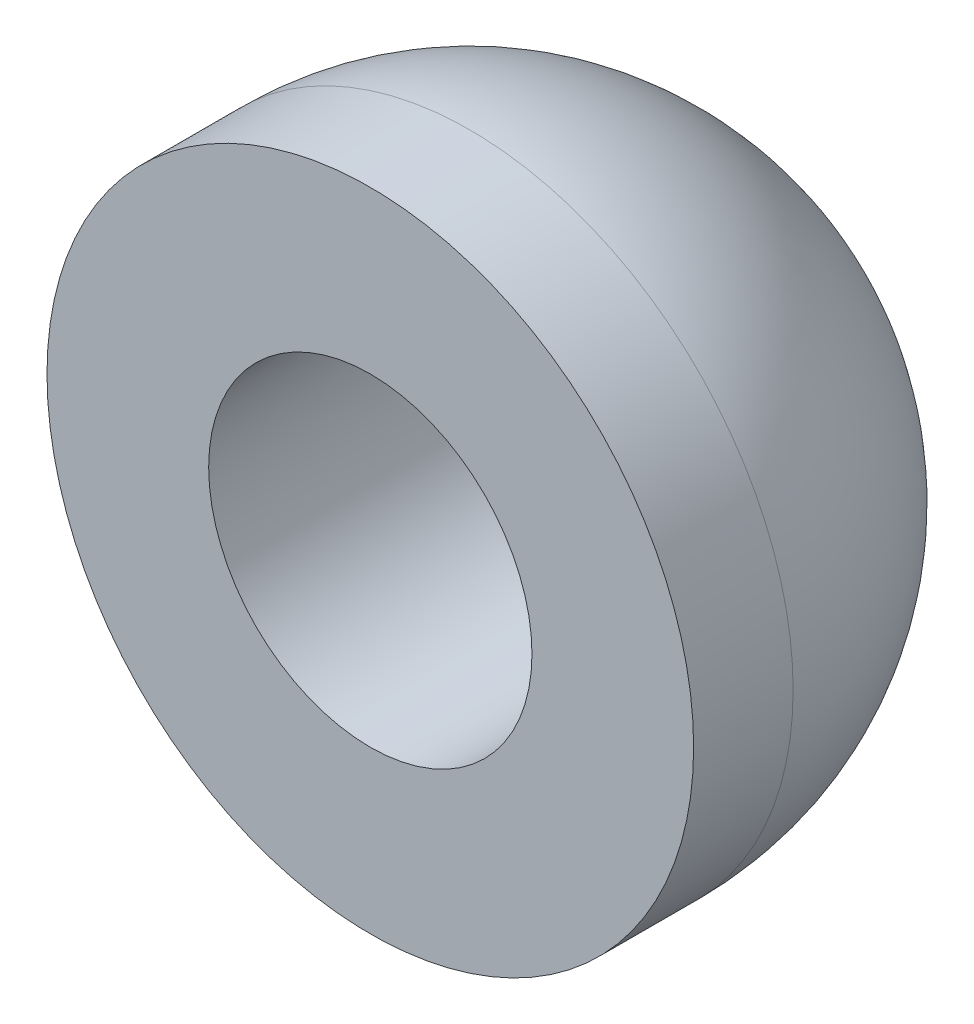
ISO-10303-21;
HEADER;
FILE_DESCRIPTION(('STEP AP214'),'2;1');
FILE_NAME('part.step','',(''),(''),'','','');
FILE_SCHEMA(('AUTOMOTIVE_DESIGN { 1 0 10303 214 1 1 1 1 }'));
ENDSEC;
DATA;
#1=APPLICATION_CONTEXT('core data for automotive mechanical design processes');
#2=APPLICATION_PROTOCOL_DEFINITION('international standard','automotive_design',2000,#1);
#3=PRODUCT_CONTEXT('',#1,'mechanical');
#4=PRODUCT('Part','Part','',(#3));
#5=PRODUCT_RELATED_PRODUCT_CATEGORY('part','',(#4));
#6=PRODUCT_DEFINITION_FORMATION('','',#4);
#7=PRODUCT_DEFINITION_CONTEXT('part definition',#1,'design');
#8=PRODUCT_DEFINITION('design','',#6,#7);
#9=PRODUCT_DEFINITION_SHAPE('','',#8);
#10=(LENGTH_UNIT() NAMED_UNIT(*) SI_UNIT(.MILLI.,.METRE.));
#11=(NAMED_UNIT(*) PLANE_ANGLE_UNIT() SI_UNIT($,.RADIAN.));
#12=(NAMED_UNIT(*) SI_UNIT($,.STERADIAN.) SOLID_ANGLE_UNIT());
#13=UNCERTAINTY_MEASURE_WITH_UNIT(LENGTH_MEASURE(1.E-05),#10,'distance_accuracy_value','');
#14=(GEOMETRIC_REPRESENTATION_CONTEXT(3) GLOBAL_UNCERTAINTY_ASSIGNED_CONTEXT((#13)) GLOBAL_UNIT_ASSIGNED_CONTEXT((#10,
#11,#12)) REPRESENTATION_CONTEXT('',''));
#15=CARTESIAN_POINT('',(0.,0.,0.));
#16=DIRECTION('',(0.,0.,1.));
#17=DIRECTION('',(1.,0.,0.));
#18=AXIS2_PLACEMENT_3D('',#15,#16,#17);
#19=CARTESIAN_POINT('',(0.,3.25,0.));
#20=DIRECTION('',(0.,0.,-1.));
#21=DIRECTION('',(-1.,0.,0.));
#22=AXIS2_PLACEMENT_3D('',#19,#20,#21);
#23=PLANE('',#22);
#24=CARTESIAN_POINT('',(0.,0.,0.));
#25=DIRECTION('',(0.,0.,1.));
#26=DIRECTION('',(1.,0.,0.));
#27=AXIS2_PLACEMENT_3D('',#24,#25,#26);
#28=CIRCLE('',#27,3.25);
#29=CARTESIAN_POINT('',(3.25,0.,0.));
#30=VERTEX_POINT('',#29);
#31=EDGE_CURVE('E10',#30,#30,#28,.T.);
#32=ORIENTED_EDGE('',*,*,#31,.F.);
#33=EDGE_LOOP('',(#32));
#34=FACE_BOUND('',#33,.T.);
#35=CARTESIAN_POINT('',(0.,0.,0.));
#36=DIRECTION('',(0.,0.,1.));
#37=DIRECTION('',(1.,0.,0.));
#38=AXIS2_PLACEMENT_3D('',#35,#36,#37);
#39=CIRCLE('',#38,6.5);
#40=CARTESIAN_POINT('',(6.5,0.,0.));
#41=VERTEX_POINT('',#40);
#42=EDGE_CURVE('E36',#41,#41,#39,.T.);
#43=ORIENTED_EDGE('',*,*,#42,.T.);
#44=EDGE_LOOP('',(#43));
#45=FACE_BOUND('',#44,.T.);
#46=ADVANCED_FACE('F25',(#34,#45),#23,.F.);
#47=CARTESIAN_POINT('',(0.,0.,0.));
#48=DIRECTION('',(0.,0.,1.));
#49=DIRECTION('',(1.,0.,0.));
#50=AXIS2_PLACEMENT_3D('',#47,#48,#49);
#51=CYLINDRICAL_SURFACE('',#50,3.25);
#52=CARTESIAN_POINT('',(0.,0.,-7.5));
#53=DIRECTION('',(0.,0.,1.));
#54=DIRECTION('',(1.,0.,0.));
#55=AXIS2_PLACEMENT_3D('',#52,#53,#54);
#56=CIRCLE('',#55,3.25);
#57=CARTESIAN_POINT('',(3.25,0.,-7.5));
#58=VERTEX_POINT('',#57);
#59=EDGE_CURVE('E41',#58,#58,#56,.F.);
#60=ORIENTED_EDGE('',*,*,#59,.T.);
#61=EDGE_LOOP('',(#60));
#62=FACE_BOUND('',#61,.T.);
#63=ORIENTED_EDGE('',*,*,#31,.T.);
#64=EDGE_LOOP('',(#63));
#65=FACE_BOUND('',#64,.T.);
#66=ADVANCED_FACE('F63',(#62,#65),#51,.F.);
#67=CARTESIAN_POINT('',(0.,0.,-2.));
#68=DIRECTION('',(0.,0.,1.));
#69=DIRECTION('',(0.,1.,0.));
#70=AXIS2_PLACEMENT_3D('',#67,#68,#69);
#71=SPHERICAL_SURFACE('',#70,6.5);
#72=CARTESIAN_POINT('',(0.,0.,-7.5));
#73=DIRECTION('',(0.,0.,1.));
#74=DIRECTION('',(1.,0.,0.));
#75=AXIS2_PLACEMENT_3D('',#72,#73,#74);
#76=CIRCLE('',#75,3.46410161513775);
#77=CARTESIAN_POINT('',(3.46410161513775,0.,-7.5));
#78=VERTEX_POINT('',#77);
#79=EDGE_CURVE('E28',#78,#78,#76,.T.);
#80=ORIENTED_EDGE('',*,*,#79,.T.);
#81=EDGE_LOOP('',(#80));
#82=FACE_BOUND('',#81,.T.);
#83=CARTESIAN_POINT('',(0.,0.,-2.));
#84=DIRECTION('',(0.,0.,1.));
#85=DIRECTION('',(1.,0.,0.));
#86=AXIS2_PLACEMENT_3D('',#83,#84,#85);
#87=CIRCLE('',#86,6.5);
#88=CARTESIAN_POINT('',(6.5,0.,-2.));
#89=VERTEX_POINT('',#88);
#90=EDGE_CURVE('E32',#89,#89,#87,.T.);
#91=ORIENTED_EDGE('',*,*,#90,.F.);
#92=EDGE_LOOP('',(#91));
#93=FACE_BOUND('',#92,.T.);
#94=ADVANCED_FACE('F48',(#82,#93),#71,.T.);
#95=CARTESIAN_POINT('',(0.,0.,0.));
#96=DIRECTION('',(0.,0.,1.));
#97=DIRECTION('',(1.,0.,0.));
#98=AXIS2_PLACEMENT_3D('',#95,#96,#97);
#99=CYLINDRICAL_SURFACE('',#98,6.5);
#100=ORIENTED_EDGE('',*,*,#42,.F.);
#101=EDGE_LOOP('',(#100));
#102=FACE_BOUND('',#101,.T.);
#103=ORIENTED_EDGE('',*,*,#90,.T.);
#104=EDGE_LOOP('',(#103));
#105=FACE_BOUND('',#104,.T.);
#106=ADVANCED_FACE('F54',(#102,#105),#99,.T.);
#107=CARTESIAN_POINT('',(0.,0.,-7.5));
#108=DIRECTION('',(0.,0.,1.));
#109=DIRECTION('',(1.,0.,0.));
#110=AXIS2_PLACEMENT_3D('',#107,#108,#109);
#111=PLANE('',#110);
#112=ORIENTED_EDGE('',*,*,#79,.F.);
#113=EDGE_LOOP('',(#112));
#114=FACE_BOUND('',#113,.T.);
#115=ORIENTED_EDGE('',*,*,#59,.F.);
#116=EDGE_LOOP('',(#115));
#117=FACE_BOUND('',#116,.T.);
#118=ADVANCED_FACE('F51',(#114,#117),#111,.F.);
#119=CLOSED_SHELL('',(#46,#66,#94,#106,#118));
#120=MANIFOLD_SOLID_BREP('B2',#119);
#121=ADVANCED_BREP_SHAPE_REPRESENTATION('',(#18,#120),#14);
#122=SHAPE_DEFINITION_REPRESENTATION(#9,#121);
ENDSEC;
END-ISO-10303-21;
